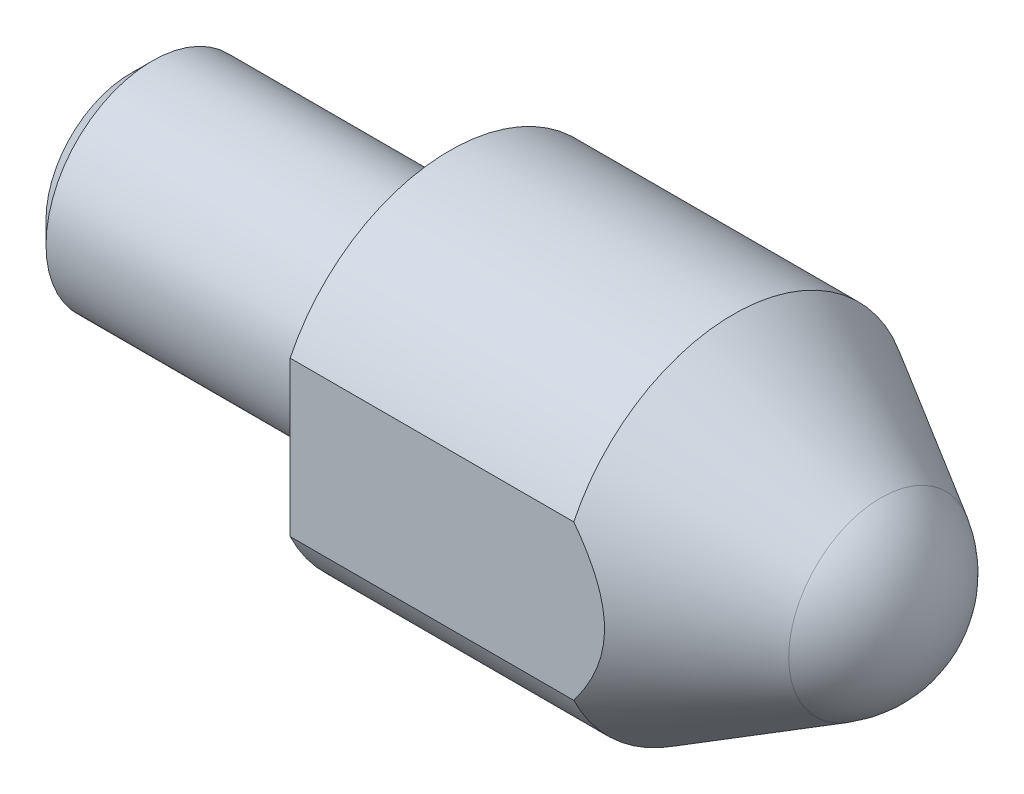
ISO-10303-21;
HEADER;
FILE_DESCRIPTION(('STEP AP214'),'2;1');
FILE_NAME('part.step','',(''),(''),'','','');
FILE_SCHEMA(('AUTOMOTIVE_DESIGN { 1 0 10303 214 1 1 1 1 }'));
ENDSEC;
DATA;
#1=APPLICATION_CONTEXT('core data for automotive mechanical design processes');
#2=APPLICATION_PROTOCOL_DEFINITION('international standard','automotive_design',2000,#1);
#3=PRODUCT_CONTEXT('',#1,'mechanical');
#4=PRODUCT('Part','Part','',(#3));
#5=PRODUCT_RELATED_PRODUCT_CATEGORY('part','',(#4));
#6=PRODUCT_DEFINITION_FORMATION('','',#4);
#7=PRODUCT_DEFINITION_CONTEXT('part definition',#1,'design');
#8=PRODUCT_DEFINITION('design','',#6,#7);
#9=PRODUCT_DEFINITION_SHAPE('','',#8);
#10=(LENGTH_UNIT() NAMED_UNIT(*) SI_UNIT(.MILLI.,.METRE.));
#11=(NAMED_UNIT(*) PLANE_ANGLE_UNIT() SI_UNIT($,.RADIAN.));
#12=(NAMED_UNIT(*) SI_UNIT($,.STERADIAN.) SOLID_ANGLE_UNIT());
#13=UNCERTAINTY_MEASURE_WITH_UNIT(LENGTH_MEASURE(1.E-05),#10,'distance_accuracy_value','');
#14=(GEOMETRIC_REPRESENTATION_CONTEXT(3) GLOBAL_UNCERTAINTY_ASSIGNED_CONTEXT((#13)) GLOBAL_UNIT_ASSIGNED_CONTEXT((#10,
#11,#12)) REPRESENTATION_CONTEXT('',''));
#15=CARTESIAN_POINT('',(0.,0.,0.));
#16=DIRECTION('',(0.,0.,1.));
#17=DIRECTION('',(1.,0.,0.));
#18=AXIS2_PLACEMENT_3D('',#15,#16,#17);
#19=CARTESIAN_POINT('',(13.6602540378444,0.,0.));
#20=DIRECTION('',(-1.,0.,0.));
#21=DIRECTION('',(0.,-1.,0.));
#22=AXIS2_PLACEMENT_3D('',#19,#20,#21);
#23=CYLINDRICAL_SURFACE('',#22,5.);
#24=CARTESIAN_POINT('',(8.,0.,0.));
#25=DIRECTION('',(-1.,0.,0.));
#26=DIRECTION('',(0.,-1.,0.));
#27=AXIS2_PLACEMENT_3D('',#24,#25,#26);
#28=CIRCLE('',#27,5.);
#29=CARTESIAN_POINT('',(8.,-2.17944947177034,-4.5));
#30=VERTEX_POINT('',#29);
#31=CARTESIAN_POINT('',(8.,-2.17944947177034,4.5));
#32=VERTEX_POINT('',#31);
#33=EDGE_CURVE('E93',#30,#32,#28,.T.);
#34=ORIENTED_EDGE('',*,*,#33,.T.);
#35=DIRECTION('',(-1.,0.,0.));
#36=VECTOR('',#35,1.);
#37=CARTESIAN_POINT('',(13.6602540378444,-2.17944947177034,4.5));
#38=LINE('',#37,#36);
#39=CARTESIAN_POINT('',(0.,-2.17944947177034,4.5));
#40=VERTEX_POINT('',#39);
#41=EDGE_CURVE('E67',#32,#40,#38,.T.);
#42=ORIENTED_EDGE('',*,*,#41,.T.);
#43=CARTESIAN_POINT('',(0.,0.,0.));
#44=DIRECTION('',(-1.,0.,0.));
#45=DIRECTION('',(0.,-1.,0.));
#46=AXIS2_PLACEMENT_3D('',#43,#44,#45);
#47=CIRCLE('',#46,5.);
#48=CARTESIAN_POINT('',(0.,-2.17944947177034,-4.5));
#49=VERTEX_POINT('',#48);
#50=EDGE_CURVE('E95',#49,#40,#47,.T.);
#51=ORIENTED_EDGE('',*,*,#50,.F.);
#52=DIRECTION('',(-1.,0.,0.));
#53=VECTOR('',#52,1.);
#54=CARTESIAN_POINT('',(13.6602540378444,-2.17944947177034,-4.5));
#55=LINE('',#54,#53);
#56=EDGE_CURVE('E83',#49,#30,#55,.F.);
#57=ORIENTED_EDGE('',*,*,#56,.T.);
#58=EDGE_LOOP('',(#34,#42,#51,#57));
#59=FACE_BOUND('',#58,.T.);
#60=ADVANCED_FACE('F39',(#59),#23,.T.);
#61=CARTESIAN_POINT('',(-9.,0.,0.));
#62=DIRECTION('',(1.,0.,0.));
#63=DIRECTION('',(0.,0.,-1.));
#64=AXIS2_PLACEMENT_3D('',#61,#62,#63);
#65=PLANE('',#64);
#66=CARTESIAN_POINT('',(-9.,0.,0.));
#67=DIRECTION('',(-1.,0.,0.));
#68=DIRECTION('',(0.,0.,1.));
#69=AXIS2_PLACEMENT_3D('',#66,#67,#68);
#70=CIRCLE('',#69,2.3865);
#71=CARTESIAN_POINT('',(-9.,0.,2.3865));
#72=VERTEX_POINT('',#71);
#73=EDGE_CURVE('E89',#72,#72,#70,.T.);
#74=ORIENTED_EDGE('',*,*,#73,.T.);
#75=EDGE_LOOP('',(#74));
#76=FACE_BOUND('',#75,.T.);
#77=ADVANCED_FACE('F41',(#76),#65,.F.);
#78=CARTESIAN_POINT('',(-8.3865,0.,0.));
#79=DIRECTION('',(1.,0.,0.));
#80=DIRECTION('',(0.,0.,-1.));
#81=AXIS2_PLACEMENT_3D('',#78,#79,#80);
#82=CONICAL_SURFACE('',#81,3.,0.78539816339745);
#83=ORIENTED_EDGE('',*,*,#73,.F.);
#84=EDGE_LOOP('',(#83));
#85=FACE_BOUND('',#84,.T.);
#86=CARTESIAN_POINT('',(-8.3865,0.,0.));
#87=DIRECTION('',(-1.,0.,0.));
#88=DIRECTION('',(0.,0.,1.));
#89=AXIS2_PLACEMENT_3D('',#86,#87,#88);
#90=CIRCLE('',#89,3.);
#91=CARTESIAN_POINT('',(-8.3865,0.,3.));
#92=VERTEX_POINT('',#91);
#93=EDGE_CURVE('E112',#92,#92,#90,.T.);
#94=ORIENTED_EDGE('',*,*,#93,.T.);
#95=EDGE_LOOP('',(#94));
#96=FACE_BOUND('',#95,.T.);
#97=ADVANCED_FACE('F140',(#85,#96),#82,.T.);
#98=CARTESIAN_POINT('',(0.,0.,0.));
#99=DIRECTION('',(-1.,0.,0.));
#100=DIRECTION('',(0.,0.,1.));
#101=AXIS2_PLACEMENT_3D('',#98,#99,#100);
#102=CYLINDRICAL_SURFACE('',#101,3.);
#103=ORIENTED_EDGE('',*,*,#93,.F.);
#104=EDGE_LOOP('',(#103));
#105=FACE_BOUND('',#104,.T.);
#106=CARTESIAN_POINT('',(0.,0.,0.));
#107=DIRECTION('',(1.,0.,0.));
#108=DIRECTION('',(0.,1.,0.));
#109=AXIS2_PLACEMENT_3D('',#106,#107,#108);
#110=CIRCLE('',#109,3.);
#111=CARTESIAN_POINT('',(0.,3.,0.));
#112=VERTEX_POINT('',#111);
#113=EDGE_CURVE('E109',#112,#112,#110,.T.);
#114=ORIENTED_EDGE('',*,*,#113,.F.);
#115=EDGE_LOOP('',(#114));
#116=FACE_BOUND('',#115,.T.);
#117=ADVANCED_FACE('F149',(#105,#116),#102,.T.);
#118=CARTESIAN_POINT('',(0.,0.,0.));
#119=DIRECTION('',(1.,0.,0.));
#120=DIRECTION('',(0.,1.,0.));
#121=AXIS2_PLACEMENT_3D('',#118,#119,#120);
#122=PLANE('',#121);
#123=ORIENTED_EDGE('',*,*,#50,.T.);
#124=DIRECTION('',(0.,1.,0.));
#125=VECTOR('',#124,1.);
#126=CARTESIAN_POINT('',(0.,0.,4.5));
#127=LINE('',#126,#125);
#128=CARTESIAN_POINT('',(0.,2.17944947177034,4.5));
#129=VERTEX_POINT('',#128);
#130=EDGE_CURVE('E103',#40,#129,#127,.T.);
#131=ORIENTED_EDGE('',*,*,#130,.T.);
#132=CARTESIAN_POINT('',(0.,2.17944947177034,-4.5));
#133=VERTEX_POINT('',#132);
#134=EDGE_CURVE('E108',#129,#133,#47,.T.);
#135=ORIENTED_EDGE('',*,*,#134,.T.);
#136=DIRECTION('',(0.,-1.,0.));
#137=VECTOR('',#136,1.);
#138=CARTESIAN_POINT('',(0.,0.,-4.5));
#139=LINE('',#138,#137);
#140=EDGE_CURVE('E157',#133,#49,#139,.T.);
#141=ORIENTED_EDGE('',*,*,#140,.T.);
#142=EDGE_LOOP('',(#123,#131,#135,#141));
#143=FACE_BOUND('',#142,.T.);
#144=ORIENTED_EDGE('',*,*,#113,.T.);
#145=EDGE_LOOP('',(#144));
#146=FACE_BOUND('',#145,.T.);
#147=ADVANCED_FACE('F144',(#143,#146),#122,.F.);
#148=ORIENTED_EDGE('',*,*,#134,.F.);
#149=DIRECTION('',(-1.,0.,0.));
#150=VECTOR('',#149,1.);
#151=CARTESIAN_POINT('',(13.6602540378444,2.17944947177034,4.5));
#152=LINE('',#151,#150);
#153=CARTESIAN_POINT('',(8.,2.17944947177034,4.5));
#154=VERTEX_POINT('',#153);
#155=EDGE_CURVE('E154',#129,#154,#152,.F.);
#156=ORIENTED_EDGE('',*,*,#155,.T.);
#157=CARTESIAN_POINT('',(8.,2.17944947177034,-4.5));
#158=VERTEX_POINT('',#157);
#159=EDGE_CURVE('E99',#154,#158,#28,.T.);
#160=ORIENTED_EDGE('',*,*,#159,.T.);
#161=DIRECTION('',(-1.,0.,0.));
#162=VECTOR('',#161,1.);
#163=CARTESIAN_POINT('',(13.6602540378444,2.17944947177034,-4.5));
#164=LINE('',#163,#162);
#165=EDGE_CURVE('E59',#158,#133,#164,.T.);
#166=ORIENTED_EDGE('',*,*,#165,.T.);
#167=EDGE_LOOP('',(#148,#156,#160,#166));
#168=FACE_BOUND('',#167,.T.);
#169=ADVANCED_FACE('F134',(#168),#23,.T.);
#170=CARTESIAN_POINT('',(12.1602540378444,0.,0.));
#171=DIRECTION('',(-1.,0.,0.));
#172=DIRECTION('',(0.,-1.,0.));
#173=AXIS2_PLACEMENT_3D('',#170,#171,#172);
#174=CONICAL_SURFACE('',#173,2.59807621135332,0.523598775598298);
#175=ORIENTED_EDGE('',*,*,#159,.F.);
#176=CARTESIAN_POINT('',(3.7082800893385,-5.97225890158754,4.5));
#177=CARTESIAN_POINT('',(3.8497839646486,-5.86995544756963,4.5));
#178=CARTESIAN_POINT('',(3.99084808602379,-5.76703888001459,4.5));
#179=CARTESIAN_POINT('',(4.27193172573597,-5.55976922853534,4.5));
#180=CARTESIAN_POINT('',(4.41195117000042,-5.4554160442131,4.5));
#181=CARTESIAN_POINT('',(4.69106825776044,-5.2448449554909,4.5));
#182=CARTESIAN_POINT('',(4.83016318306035,-5.13862344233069,4.5));
#183=CARTESIAN_POINT('',(5.10688161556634,-4.92428460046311,4.5));
#184=CARTESIAN_POINT('',(5.24450515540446,-4.81616731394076,4.5));
#185=CARTESIAN_POINT('',(5.52416198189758,-4.59279234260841,4.5));
#186=CARTESIAN_POINT('',(5.66611394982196,-4.47743262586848,4.5));
#187=CARTESIAN_POINT('',(5.94764866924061,-4.24385929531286,4.5));
#188=CARTESIAN_POINT('',(6.08723149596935,-4.12564577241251,4.5));
#189=CARTESIAN_POINT('',(6.36331685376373,-3.88591293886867,4.5));
#190=CARTESIAN_POINT('',(6.49982206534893,-3.76439672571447,4.5));
#191=CARTESIAN_POINT('',(6.76905720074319,-3.5172655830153,4.5));
#192=CARTESIAN_POINT('',(6.90178757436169,-3.39165114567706,4.5));
#193=CARTESIAN_POINT('',(7.16677568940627,-3.13106350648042,4.5));
#194=CARTESIAN_POINT('',(7.2988644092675,-2.99591735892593,4.5));
#195=CARTESIAN_POINT('',(7.55606584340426,-2.71890443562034,4.5));
#196=CARTESIAN_POINT('',(7.68117376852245,-2.57703316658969,4.5));
#197=CARTESIAN_POINT('',(7.92011972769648,-2.2867983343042,4.5));
#198=CARTESIAN_POINT('',(8.03407239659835,-2.1385300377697,4.5));
#199=CARTESIAN_POINT('',(8.24810573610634,-1.83239291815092,4.5));
#200=CARTESIAN_POINT('',(8.34820942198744,-1.67454066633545,4.5));
#201=CARTESIAN_POINT('',(8.47634798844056,-1.44211459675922,4.5));
#202=CARTESIAN_POINT('',(8.51262389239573,-1.37207742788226,4.5));
#203=CARTESIAN_POINT('',(8.58105110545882,-1.2298521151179,4.5));
#204=CARTESIAN_POINT('',(8.61319373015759,-1.15765982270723,4.5));
#205=CARTESIAN_POINT('',(8.70239751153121,-0.937761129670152,4.5));
#206=CARTESIAN_POINT('',(8.75214735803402,-0.786885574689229,4.5));
#207=CARTESIAN_POINT('',(8.80784477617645,-0.556128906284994,4.5));
#208=CARTESIAN_POINT('',(8.82325671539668,-0.478460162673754,4.5));
#209=CARTESIAN_POINT('',(8.84724747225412,-0.322085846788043,4.5));
#210=CARTESIAN_POINT('',(8.85582956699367,-0.243380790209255,4.5));
#211=CARTESIAN_POINT('',(8.86584533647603,-0.0850483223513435,4.5));
#212=CARTESIAN_POINT('',(8.86723647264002,-0.00541820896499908,4.5));
#213=CARTESIAN_POINT('',(8.86270069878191,0.153631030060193,4.5));
#214=CARTESIAN_POINT('',(8.85677376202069,0.233050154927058,4.5));
#215=CARTESIAN_POINT('',(8.8378464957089,0.391014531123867,4.5));
#216=CARTESIAN_POINT('',(8.82484802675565,0.469560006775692,4.5));
#217=CARTESIAN_POINT('',(8.79228085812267,0.625294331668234,4.5));
#218=CARTESIAN_POINT('',(8.77270825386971,0.70248234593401,4.5));
#219=CARTESIAN_POINT('',(8.6901629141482,0.981867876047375,4.5));
#220=CARTESIAN_POINT('',(8.60908207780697,1.17887062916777,4.5));
#221=CARTESIAN_POINT('',(8.46592189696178,1.46311603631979,4.5));
#222=CARTESIAN_POINT('',(8.41446171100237,1.55619879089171,4.5));
#223=CARTESIAN_POINT('',(8.30566051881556,1.73888898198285,4.5));
#224=CARTESIAN_POINT('',(8.24832045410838,1.82849697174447,4.5));
#225=CARTESIAN_POINT('',(8.10378260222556,2.04148658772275,4.5));
#226=CARTESIAN_POINT('',(8.01417241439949,2.16321672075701,4.5));
#227=CARTESIAN_POINT('',(7.82779745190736,2.4011122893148,4.5));
#228=CARTESIAN_POINT('',(7.73102882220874,2.51727467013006,4.5));
#229=CARTESIAN_POINT('',(7.53189425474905,2.74505612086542,4.5));
#230=CARTESIAN_POINT('',(7.42951803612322,2.85666614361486,4.5));
#231=CARTESIAN_POINT('',(7.22055357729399,3.07587681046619,4.5));
#232=CARTESIAN_POINT('',(7.11396477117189,3.18347691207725,4.5));
#233=CARTESIAN_POINT('',(6.89611019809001,3.39661503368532,4.5));
#234=CARTESIAN_POINT('',(6.78480239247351,3.50210991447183,4.5));
#235=CARTESIAN_POINT('',(6.55946589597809,3.71015177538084,4.5));
#236=CARTESIAN_POINT('',(6.4454370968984,3.81269863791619,4.5));
#237=CARTESIAN_POINT('',(6.21532179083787,4.01514134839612,4.5));
#238=CARTESIAN_POINT('',(6.0992381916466,4.11504050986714,4.5));
#239=CARTESIAN_POINT('',(5.86525722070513,4.31267719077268,4.5));
#240=CARTESIAN_POINT('',(5.74735992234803,4.41041479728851,4.5));
#241=CARTESIAN_POINT('',(5.48612927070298,4.62353930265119,4.5));
#242=CARTESIAN_POINT('',(5.342458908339,4.73851272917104,4.5));
#243=CARTESIAN_POINT('',(5.05332090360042,4.96617970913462,4.5));
#244=CARTESIAN_POINT('',(4.90785320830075,5.07887319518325,4.5));
#245=CARTESIAN_POINT('',(4.46919456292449,5.41407112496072,4.5));
#246=CARTESIAN_POINT('',(4.17378053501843,5.63366682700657,4.5));
#247=CARTESIAN_POINT('',(3.57861710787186,6.06716321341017,4.5));
#248=CARTESIAN_POINT('',(3.27886574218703,6.28106118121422,4.5));
#249=CARTESIAN_POINT('',(2.67622217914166,6.70439504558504,4.5));
#250=CARTESIAN_POINT('',(2.37332989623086,6.91383082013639,4.5));
#251=CARTESIAN_POINT('',(1.7644040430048,7.32969760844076,4.5));
#252=CARTESIAN_POINT('',(1.45836458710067,7.5361199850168,4.5));
#253=CARTESIAN_POINT('',(0.844393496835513,7.94613668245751,4.5));
#254=CARTESIAN_POINT('',(0.536461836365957,8.14973096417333,4.5));
#255=CARTESIAN_POINT('',(-0.0808203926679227,8.55455450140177,4.5));
#256=CARTESIAN_POINT('',(-0.390170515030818,8.75578443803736,4.5));
#257=CARTESIAN_POINT('',(-1.01010187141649,9.15633990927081,4.5));
#258=CARTESIAN_POINT('',(-1.32068311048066,9.35566543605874,4.5));
#259=CARTESIAN_POINT('',(-2.18226352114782,9.90551967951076,4.5));
#260=CARTESIAN_POINT('',(-2.73434019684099,10.2543597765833,4.5));
#261=CARTESIAN_POINT('',(-3.84085667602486,10.9483701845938,4.5));
#262=CARTESIAN_POINT('',(-4.39529667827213,11.2935401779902,4.5));
#263=CARTESIAN_POINT('',(-5.50348325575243,11.9795261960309,4.5));
#264=CARTESIAN_POINT('',(-6.05722210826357,12.320354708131,4.5));
#265=CARTESIAN_POINT('',(-7.166017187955,12.9997323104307,4.5));
#266=CARTESIAN_POINT('',(-7.72107327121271,13.3382816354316,4.5));
#267=CARTESIAN_POINT('',(-8.27663475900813,13.6759938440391,4.5));
#268=B_SPLINE_CURVE_WITH_KNOTS('',3,(#176,#177,#178,#179,#180,#181,#182,#183,#184,#185,#186,
#187,#188,#189,#190,#191,#192,#193,#194,#195,#196,#197,#198,#199,#200,#201,#202,#203,#204,#205,
#206,#207,#208,#209,#210,#211,#212,#213,#214,#215,#216,#217,#218,#219,#220,#221,#222,#223,#224,
#225,#226,#227,#228,#229,#230,#231,#232,#233,#234,#235,#236,#237,#238,#239,#240,#241,#242,#243,
#244,#245,#246,#247,#248,#249,#250,#251,#252,#253,#254,#255,#256,#257,#258,#259,#260,#261,#262,
#263,#264,#265,#266,#267),.UNSPECIFIED.,.F.,.F.,(4,2,2,2,2,2,2,2,2,2,2,2,2,2,2,2,2,2,2,2,2,2,2,
2,2,2,2,2,2,2,2,2,2,2,2,2,2,2,2,2,2,2,2,2,2,4),(0.,0.523838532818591,1.0477138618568,
1.572745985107,2.09776644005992,2.64648306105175,3.19518222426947,3.74338342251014,
4.29151902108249,4.85826326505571,5.42539165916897,5.98589123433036,6.54544784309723,
6.78194396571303,7.01892914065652,7.49342358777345,7.73072605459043,7.96791458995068,
8.20650463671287,8.44509555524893,8.68362372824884,8.9222938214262,9.55717671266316,
9.87616020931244,10.1950927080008,10.6482037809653,11.1015606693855,11.5557785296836,
12.010057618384,12.4700677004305,12.9300961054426,13.3895186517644,13.8489226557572,
14.4009269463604,14.9529475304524,16.0571138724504,17.1617975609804,18.2665114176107,
19.3739368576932,20.48137761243,21.588491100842,22.6956091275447,24.6547455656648,
26.6140501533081,28.5647151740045,30.5151760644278),.UNSPECIFIED.);
#269=EDGE_CURVE('E11',#154,#32,#268,.F.);
#270=ORIENTED_EDGE('',*,*,#269,.T.);
#271=ORIENTED_EDGE('',*,*,#33,.F.);
#272=CARTESIAN_POINT('',(3.7082800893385,-5.97225890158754,-4.5));
#273=CARTESIAN_POINT('',(3.8497839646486,-5.86995544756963,-4.5));
#274=CARTESIAN_POINT('',(3.99084808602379,-5.76703888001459,-4.5));
#275=CARTESIAN_POINT('',(4.27193172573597,-5.55976922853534,-4.5));
#276=CARTESIAN_POINT('',(4.41195117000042,-5.4554160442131,-4.5));
#277=CARTESIAN_POINT('',(4.69106825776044,-5.2448449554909,-4.5));
#278=CARTESIAN_POINT('',(4.83016318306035,-5.13862344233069,-4.5));
#279=CARTESIAN_POINT('',(5.10688161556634,-4.92428460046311,-4.5));
#280=CARTESIAN_POINT('',(5.24450515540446,-4.81616731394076,-4.5));
#281=CARTESIAN_POINT('',(5.52416198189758,-4.59279234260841,-4.5));
#282=CARTESIAN_POINT('',(5.66611394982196,-4.47743262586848,-4.5));
#283=CARTESIAN_POINT('',(5.94764866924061,-4.24385929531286,-4.5));
#284=CARTESIAN_POINT('',(6.08723149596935,-4.12564577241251,-4.5));
#285=CARTESIAN_POINT('',(6.36331685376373,-3.88591293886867,-4.5));
#286=CARTESIAN_POINT('',(6.49982206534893,-3.76439672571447,-4.5));
#287=CARTESIAN_POINT('',(6.76905720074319,-3.5172655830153,-4.5));
#288=CARTESIAN_POINT('',(6.90178757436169,-3.39165114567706,-4.5));
#289=CARTESIAN_POINT('',(7.16677568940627,-3.13106350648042,-4.5));
#290=CARTESIAN_POINT('',(7.2988644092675,-2.99591735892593,-4.5));
#291=CARTESIAN_POINT('',(7.55606584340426,-2.71890443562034,-4.5));
#292=CARTESIAN_POINT('',(7.68117376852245,-2.57703316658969,-4.5));
#293=CARTESIAN_POINT('',(7.92011972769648,-2.2867983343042,-4.5));
#294=CARTESIAN_POINT('',(8.03407239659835,-2.1385300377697,-4.5));
#295=CARTESIAN_POINT('',(8.24810573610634,-1.83239291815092,-4.5));
#296=CARTESIAN_POINT('',(8.34820942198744,-1.67454066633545,-4.5));
#297=CARTESIAN_POINT('',(8.47634798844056,-1.44211459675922,-4.5));
#298=CARTESIAN_POINT('',(8.51262389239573,-1.37207742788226,-4.5));
#299=CARTESIAN_POINT('',(8.58105110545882,-1.2298521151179,-4.5));
#300=CARTESIAN_POINT('',(8.61319373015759,-1.15765982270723,-4.5));
#301=CARTESIAN_POINT('',(8.70239751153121,-0.937761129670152,-4.5));
#302=CARTESIAN_POINT('',(8.75214735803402,-0.786885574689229,-4.5));
#303=CARTESIAN_POINT('',(8.80784477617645,-0.556128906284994,-4.5));
#304=CARTESIAN_POINT('',(8.82325671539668,-0.478460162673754,-4.5));
#305=CARTESIAN_POINT('',(8.84724747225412,-0.322085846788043,-4.5));
#306=CARTESIAN_POINT('',(8.85582956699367,-0.243380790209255,-4.5));
#307=CARTESIAN_POINT('',(8.86584533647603,-0.0850483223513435,-4.5));
#308=CARTESIAN_POINT('',(8.86723647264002,-0.00541820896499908,-4.5));
#309=CARTESIAN_POINT('',(8.86270069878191,0.153631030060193,-4.5));
#310=CARTESIAN_POINT('',(8.85677376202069,0.233050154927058,-4.5));
#311=CARTESIAN_POINT('',(8.8378464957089,0.391014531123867,-4.5));
#312=CARTESIAN_POINT('',(8.82484802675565,0.469560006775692,-4.5));
#313=CARTESIAN_POINT('',(8.79228085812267,0.625294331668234,-4.5));
#314=CARTESIAN_POINT('',(8.77270825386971,0.70248234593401,-4.5));
#315=CARTESIAN_POINT('',(8.6901629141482,0.981867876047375,-4.5));
#316=CARTESIAN_POINT('',(8.60908207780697,1.17887062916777,-4.5));
#317=CARTESIAN_POINT('',(8.46592189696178,1.46311603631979,-4.5));
#318=CARTESIAN_POINT('',(8.41446171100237,1.55619879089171,-4.5));
#319=CARTESIAN_POINT('',(8.30566051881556,1.73888898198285,-4.5));
#320=CARTESIAN_POINT('',(8.24832045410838,1.82849697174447,-4.5));
#321=CARTESIAN_POINT('',(8.10378260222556,2.04148658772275,-4.5));
#322=CARTESIAN_POINT('',(8.01417241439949,2.16321672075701,-4.5));
#323=CARTESIAN_POINT('',(7.82779745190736,2.4011122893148,-4.5));
#324=CARTESIAN_POINT('',(7.73102882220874,2.51727467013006,-4.5));
#325=CARTESIAN_POINT('',(7.53189425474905,2.74505612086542,-4.5));
#326=CARTESIAN_POINT('',(7.42951803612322,2.85666614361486,-4.5));
#327=CARTESIAN_POINT('',(7.22055357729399,3.07587681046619,-4.5));
#328=CARTESIAN_POINT('',(7.11396477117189,3.18347691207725,-4.5));
#329=CARTESIAN_POINT('',(6.89611019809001,3.39661503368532,-4.5));
#330=CARTESIAN_POINT('',(6.78480239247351,3.50210991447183,-4.5));
#331=CARTESIAN_POINT('',(6.55946589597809,3.71015177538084,-4.5));
#332=CARTESIAN_POINT('',(6.4454370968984,3.81269863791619,-4.5));
#333=CARTESIAN_POINT('',(6.21532179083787,4.01514134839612,-4.5));
#334=CARTESIAN_POINT('',(6.0992381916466,4.11504050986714,-4.5));
#335=CARTESIAN_POINT('',(5.86525722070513,4.31267719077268,-4.5));
#336=CARTESIAN_POINT('',(5.74735992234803,4.41041479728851,-4.5));
#337=CARTESIAN_POINT('',(5.48612927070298,4.62353930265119,-4.5));
#338=CARTESIAN_POINT('',(5.342458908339,4.73851272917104,-4.5));
#339=CARTESIAN_POINT('',(5.05332090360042,4.96617970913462,-4.5));
#340=CARTESIAN_POINT('',(4.90785320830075,5.07887319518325,-4.5));
#341=CARTESIAN_POINT('',(4.46919456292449,5.41407112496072,-4.5));
#342=CARTESIAN_POINT('',(4.17378053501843,5.63366682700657,-4.5));
#343=CARTESIAN_POINT('',(3.57861710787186,6.06716321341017,-4.5));
#344=CARTESIAN_POINT('',(3.27886574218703,6.28106118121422,-4.5));
#345=CARTESIAN_POINT('',(2.67622217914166,6.70439504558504,-4.5));
#346=CARTESIAN_POINT('',(2.37332989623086,6.91383082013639,-4.5));
#347=CARTESIAN_POINT('',(1.7644040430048,7.32969760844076,-4.5));
#348=CARTESIAN_POINT('',(1.45836458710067,7.5361199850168,-4.5));
#349=CARTESIAN_POINT('',(0.844393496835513,7.94613668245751,-4.5));
#350=CARTESIAN_POINT('',(0.536461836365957,8.14973096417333,-4.5));
#351=CARTESIAN_POINT('',(-0.0808203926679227,8.55455450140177,-4.5));
#352=CARTESIAN_POINT('',(-0.390170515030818,8.75578443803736,-4.5));
#353=CARTESIAN_POINT('',(-1.01010187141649,9.15633990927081,-4.5));
#354=CARTESIAN_POINT('',(-1.32068311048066,9.35566543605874,-4.5));
#355=CARTESIAN_POINT('',(-2.18226352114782,9.90551967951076,-4.5));
#356=CARTESIAN_POINT('',(-2.73434019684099,10.2543597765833,-4.5));
#357=CARTESIAN_POINT('',(-3.84085667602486,10.9483701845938,-4.5));
#358=CARTESIAN_POINT('',(-4.39529667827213,11.2935401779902,-4.5));
#359=CARTESIAN_POINT('',(-5.50348325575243,11.9795261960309,-4.5));
#360=CARTESIAN_POINT('',(-6.05722210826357,12.320354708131,-4.5));
#361=CARTESIAN_POINT('',(-7.166017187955,12.9997323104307,-4.5));
#362=CARTESIAN_POINT('',(-7.72107327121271,13.3382816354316,-4.5));
#363=CARTESIAN_POINT('',(-8.27663475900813,13.6759938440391,-4.5));
#364=B_SPLINE_CURVE_WITH_KNOTS('',3,(#272,#273,#274,#275,#276,#277,#278,#279,#280,#281,#282,
#283,#284,#285,#286,#287,#288,#289,#290,#291,#292,#293,#294,#295,#296,#297,#298,#299,#300,#301,
#302,#303,#304,#305,#306,#307,#308,#309,#310,#311,#312,#313,#314,#315,#316,#317,#318,#319,#320,
#321,#322,#323,#324,#325,#326,#327,#328,#329,#330,#331,#332,#333,#334,#335,#336,#337,#338,#339,
#340,#341,#342,#343,#344,#345,#346,#347,#348,#349,#350,#351,#352,#353,#354,#355,#356,#357,#358,
#359,#360,#361,#362,#363),.UNSPECIFIED.,.F.,.F.,(4,2,2,2,2,2,2,2,2,2,2,2,2,2,2,2,2,2,2,2,2,2,2,
2,2,2,2,2,2,2,2,2,2,2,2,2,2,2,2,2,2,2,2,2,2,4),(0.,0.523838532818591,1.0477138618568,
1.572745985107,2.09776644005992,2.64648306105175,3.19518222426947,3.74338342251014,
4.29151902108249,4.85826326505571,5.42539165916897,5.98589123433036,6.54544784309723,
6.78194396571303,7.01892914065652,7.49342358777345,7.73072605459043,7.96791458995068,
8.20650463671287,8.44509555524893,8.68362372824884,8.9222938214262,9.55717671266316,
9.87616020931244,10.1950927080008,10.6482037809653,11.1015606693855,11.5557785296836,
12.010057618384,12.4700677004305,12.9300961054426,13.3895186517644,13.8489226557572,
14.4009269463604,14.9529475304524,16.0571138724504,17.1617975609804,18.2665114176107,
19.3739368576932,20.48137761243,21.588491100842,22.6956091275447,24.6547455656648,
26.6140501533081,28.5647151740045,30.5151760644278),.UNSPECIFIED.);
#365=EDGE_CURVE('E52',#30,#158,#364,.T.);
#366=ORIENTED_EDGE('',*,*,#365,.T.);
#367=EDGE_LOOP('',(#175,#270,#271,#366));
#368=FACE_BOUND('',#367,.T.);
#369=CARTESIAN_POINT('',(12.1602540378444,0.,0.));
#370=DIRECTION('',(-1.,0.,0.));
#371=DIRECTION('',(0.,-1.,0.));
#372=AXIS2_PLACEMENT_3D('',#369,#370,#371);
#373=CIRCLE('',#372,2.59807621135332);
#374=CARTESIAN_POINT('',(12.1602540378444,-2.59807621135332,0.));
#375=VERTEX_POINT('',#374);
#376=EDGE_CURVE('E100',#375,#375,#373,.T.);
#377=ORIENTED_EDGE('',*,*,#376,.T.);
#378=EDGE_LOOP('',(#377));
#379=FACE_BOUND('',#378,.T.);
#380=ADVANCED_FACE('F97',(#368,#379),#174,.T.);
#381=CARTESIAN_POINT('',(10.6602540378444,0.,0.));
#382=DIRECTION('',(-1.,0.,0.));
#383=DIRECTION('',(0.,1.,0.));
#384=AXIS2_PLACEMENT_3D('',#381,#382,#383);
#385=SPHERICAL_SURFACE('',#384,3.);
#386=ORIENTED_EDGE('',*,*,#376,.F.);
#387=EDGE_LOOP('',(#386));
#388=FACE_BOUND('',#387,.T.);
#389=ADVANCED_FACE('F126',(#388),#385,.T.);
#390=CARTESIAN_POINT('',(12.,-10.,-4.5));
#391=DIRECTION('',(0.,0.,1.));
#392=DIRECTION('',(1.,0.,0.));
#393=AXIS2_PLACEMENT_3D('',#390,#391,#392);
#394=PLANE('',#393);
#395=ORIENTED_EDGE('',*,*,#165,.F.);
#396=ORIENTED_EDGE('',*,*,#365,.F.);
#397=ORIENTED_EDGE('',*,*,#56,.F.);
#398=ORIENTED_EDGE('',*,*,#140,.F.);
#399=EDGE_LOOP('',(#395,#396,#397,#398));
#400=FACE_BOUND('',#399,.T.);
#401=ADVANCED_FACE('F82',(#400),#394,.F.);
#402=CARTESIAN_POINT('',(12.,10.,4.5));
#403=DIRECTION('',(0.,0.,-1.));
#404=DIRECTION('',(-1.,0.,0.));
#405=AXIS2_PLACEMENT_3D('',#402,#403,#404);
#406=PLANE('',#405);
#407=ORIENTED_EDGE('',*,*,#41,.F.);
#408=ORIENTED_EDGE('',*,*,#269,.F.);
#409=ORIENTED_EDGE('',*,*,#155,.F.);
#410=ORIENTED_EDGE('',*,*,#130,.F.);
#411=EDGE_LOOP('',(#407,#408,#409,#410));
#412=FACE_BOUND('',#411,.T.);
#413=ADVANCED_FACE('F125',(#412),#406,.F.);
#414=CLOSED_SHELL('',(#60,#77,#97,#117,#147,#169,#380,#389,#401,#413));
#415=MANIFOLD_SOLID_BREP('B2',#414);
#416=ADVANCED_BREP_SHAPE_REPRESENTATION('',(#18,#415),#14);
#417=SHAPE_DEFINITION_REPRESENTATION(#9,#416);
ENDSEC;
END-ISO-10303-21;
